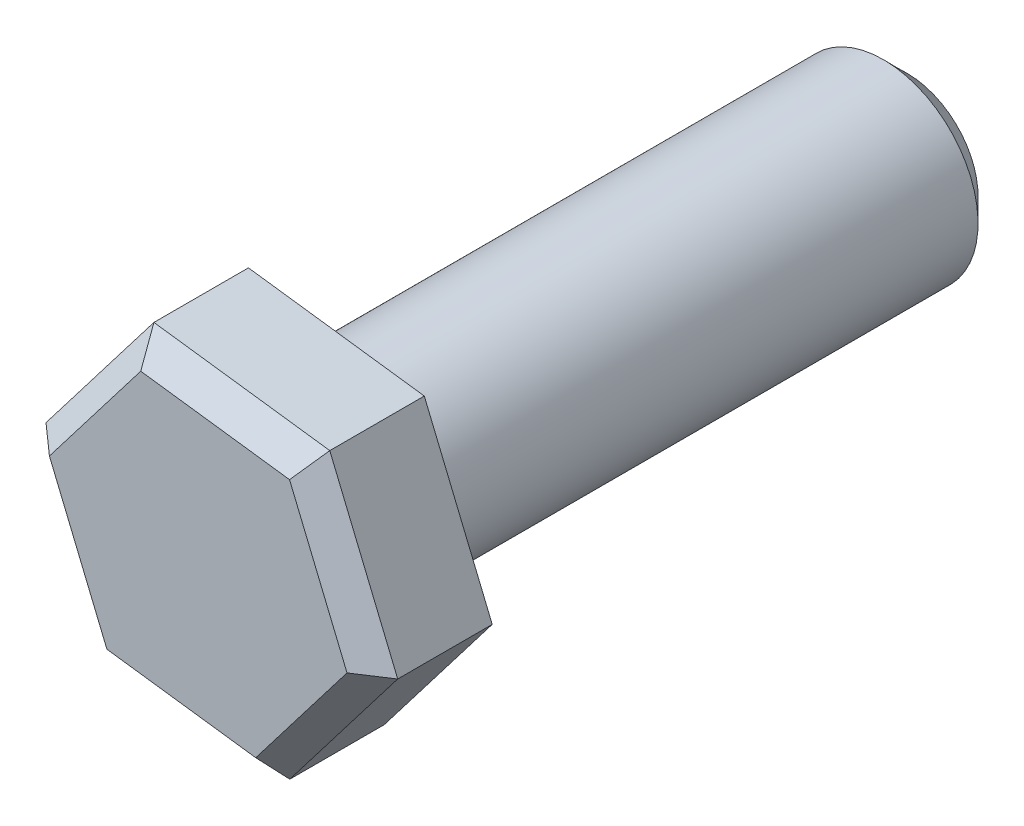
ISO-10303-21;
HEADER;
FILE_DESCRIPTION(('STEP AP214'),'2;1');
FILE_NAME('part.step','',(''),(''),'','','');
FILE_SCHEMA(('AUTOMOTIVE_DESIGN { 1 0 10303 214 1 1 1 1 }'));
ENDSEC;
DATA;
#1=APPLICATION_CONTEXT('core data for automotive mechanical design processes');
#2=APPLICATION_PROTOCOL_DEFINITION('international standard','automotive_design',2000,#1);
#3=PRODUCT_CONTEXT('',#1,'mechanical');
#4=PRODUCT('Part','Part','',(#3));
#5=PRODUCT_RELATED_PRODUCT_CATEGORY('part','',(#4));
#6=PRODUCT_DEFINITION_FORMATION('','',#4);
#7=PRODUCT_DEFINITION_CONTEXT('part definition',#1,'design');
#8=PRODUCT_DEFINITION('design','',#6,#7);
#9=PRODUCT_DEFINITION_SHAPE('','',#8);
#10=(LENGTH_UNIT() NAMED_UNIT(*) SI_UNIT(.MILLI.,.METRE.));
#11=(NAMED_UNIT(*) PLANE_ANGLE_UNIT() SI_UNIT($,.RADIAN.));
#12=(NAMED_UNIT(*) SI_UNIT($,.STERADIAN.) SOLID_ANGLE_UNIT());
#13=UNCERTAINTY_MEASURE_WITH_UNIT(LENGTH_MEASURE(1.E-05),#10,'distance_accuracy_value','');
#14=(GEOMETRIC_REPRESENTATION_CONTEXT(3) GLOBAL_UNCERTAINTY_ASSIGNED_CONTEXT((#13)) GLOBAL_UNIT_ASSIGNED_CONTEXT((#10,
#11,#12)) REPRESENTATION_CONTEXT('',''));
#15=CARTESIAN_POINT('',(0.,0.,0.));
#16=DIRECTION('',(0.,0.,1.));
#17=DIRECTION('',(1.,0.,0.));
#18=AXIS2_PLACEMENT_3D('',#15,#16,#17);
#19=CARTESIAN_POINT('',(829.485833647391,146.917769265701,43.5000000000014));
#20=DIRECTION('',(0.,0.,1.));
#21=DIRECTION('',(0.923728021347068,0.383049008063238,0.));
#22=AXIS2_PLACEMENT_3D('',#19,#20,#21);
#23=PLANE('',#22);
#24=DIRECTION('',(-0.991496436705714,0.130133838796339,0.));
#25=VECTOR('',#24,1.);
#26=CARTESIAN_POINT('',(829.485833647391,146.917769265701,43.5000000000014));
#27=LINE('',#26,#25);
#28=CARTESIAN_POINT('',(829.485833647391,146.917769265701,43.5000000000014));
#29=VERTEX_POINT('',#28);
#30=CARTESIAN_POINT('',(822.044104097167,147.894495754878,43.5000000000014));
#31=VERTEX_POINT('',#30);
#32=EDGE_CURVE('E100',#29,#31,#27,.T.);
#33=ORIENTED_EDGE('',*,*,#32,.T.);
#34=DIRECTION('',(-0.383049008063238,0.923728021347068,0.));
#35=VECTOR('',#34,1.);
#36=CARTESIAN_POINT('',(822.044104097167,147.894495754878,43.5000000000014));
#37=LINE('',#36,#35);
#38=CARTESIAN_POINT('',(819.169109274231,154.827585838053,43.5000000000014));
#39=VERTEX_POINT('',#38);
#40=EDGE_CURVE('E88',#31,#39,#37,.T.);
#41=ORIENTED_EDGE('',*,*,#40,.T.);
#42=DIRECTION('',(0.608447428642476,0.793594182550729,0.));
#43=VECTOR('',#42,1.);
#44=CARTESIAN_POINT('',(819.169109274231,154.827585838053,43.5000000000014));
#45=LINE('',#44,#43);
#46=CARTESIAN_POINT('',(823.735844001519,160.783949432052,43.5000000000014));
#47=VERTEX_POINT('',#46);
#48=EDGE_CURVE('E99',#39,#47,#45,.T.);
#49=ORIENTED_EDGE('',*,*,#48,.T.);
#50=DIRECTION('',(0.991496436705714,-0.130133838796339,0.));
#51=VECTOR('',#50,1.);
#52=CARTESIAN_POINT('',(823.735844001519,160.783949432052,43.5000000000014));
#53=LINE('',#52,#51);
#54=CARTESIAN_POINT('',(831.177573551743,159.807222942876,43.5000000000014));
#55=VERTEX_POINT('',#54);
#56=EDGE_CURVE('E178',#47,#55,#53,.T.);
#57=ORIENTED_EDGE('',*,*,#56,.T.);
#58=DIRECTION('',(0.383049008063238,-0.923728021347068,0.));
#59=VECTOR('',#58,1.);
#60=CARTESIAN_POINT('',(831.177573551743,159.807222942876,43.5000000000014));
#61=LINE('',#60,#59);
#62=CARTESIAN_POINT('',(834.052568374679,152.8741328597,43.5000000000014));
#63=VERTEX_POINT('',#62);
#64=EDGE_CURVE('E157',#55,#63,#61,.T.);
#65=ORIENTED_EDGE('',*,*,#64,.T.);
#66=DIRECTION('',(-0.608447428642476,-0.793594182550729,0.));
#67=VECTOR('',#66,1.);
#68=CARTESIAN_POINT('',(834.052568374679,152.8741328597,43.5000000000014));
#69=LINE('',#68,#67);
#70=EDGE_CURVE('E105',#63,#29,#69,.T.);
#71=ORIENTED_EDGE('',*,*,#70,.T.);
#72=EDGE_LOOP('',(#33,#41,#49,#57,#65,#71));
#73=FACE_BOUND('',#72,.T.);
#74=CARTESIAN_POINT('',(826.610838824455,153.850859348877,43.5000000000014));
#75=DIRECTION('',(0.,0.,1.));
#76=DIRECTION('',(0.923728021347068,0.383049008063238,0.));
#77=AXIS2_PLACEMENT_3D('',#74,#75,#76);
#78=CIRCLE('',#77,4.);
#79=CARTESIAN_POINT('',(830.305750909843,155.38305538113,43.5000000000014));
#80=VERTEX_POINT('',#79);
#81=EDGE_CURVE('E110',#80,#80,#78,.F.);
#82=ORIENTED_EDGE('',*,*,#81,.F.);
#83=EDGE_LOOP('',(#82));
#84=FACE_BOUND('',#83,.T.);
#85=ADVANCED_FACE('F16',(#73,#84),#23,.F.);
#86=CARTESIAN_POINT('',(829.485833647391,146.917769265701,43.5000000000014));
#87=DIRECTION('',(0.130133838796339,0.991496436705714,0.));
#88=DIRECTION('',(0.991496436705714,-0.130133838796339,0.));
#89=AXIS2_PLACEMENT_3D('',#86,#87,#88);
#90=PLANE('',#89);
#91=DIRECTION('',(0.,0.,1.));
#92=VECTOR('',#91,1.);
#93=CARTESIAN_POINT('',(829.485833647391,146.917769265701,43.5000000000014));
#94=LINE('',#93,#92);
#95=CARTESIAN_POINT('',(829.485833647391,146.917769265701,47.5000000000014));
#96=VERTEX_POINT('',#95);
#97=EDGE_CURVE('E182',#29,#96,#94,.T.);
#98=ORIENTED_EDGE('',*,*,#97,.T.);
#99=DIRECTION('',(-0.991496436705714,0.130133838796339,0.));
#100=VECTOR('',#99,1.);
#101=CARTESIAN_POINT('',(822.044104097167,147.894495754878,47.5000000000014));
#102=LINE('',#101,#100);
#103=CARTESIAN_POINT('',(822.044104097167,147.894495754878,47.5000000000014));
#104=VERTEX_POINT('',#103);
#105=EDGE_CURVE('E11',#96,#104,#102,.T.);
#106=ORIENTED_EDGE('',*,*,#105,.T.);
#107=DIRECTION('',(0.,0.,1.));
#108=VECTOR('',#107,1.);
#109=CARTESIAN_POINT('',(822.044104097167,147.894495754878,43.5000000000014));
#110=LINE('',#109,#108);
#111=EDGE_CURVE('E93',#31,#104,#110,.T.);
#112=ORIENTED_EDGE('',*,*,#111,.F.);
#113=ORIENTED_EDGE('',*,*,#32,.F.);
#114=EDGE_LOOP('',(#98,#106,#112,#113));
#115=FACE_BOUND('',#114,.T.);
#116=ADVANCED_FACE('F18',(#115),#90,.F.);
#117=CARTESIAN_POINT('',(822.044104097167,147.894495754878,43.5000000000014));
#118=DIRECTION('',(0.923728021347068,0.383049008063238,0.));
#119=DIRECTION('',(0.,0.,-1.));
#120=AXIS2_PLACEMENT_3D('',#117,#118,#119);
#121=PLANE('',#120);
#122=ORIENTED_EDGE('',*,*,#111,.T.);
#123=DIRECTION('',(-0.383049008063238,0.923728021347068,0.));
#124=VECTOR('',#123,1.);
#125=CARTESIAN_POINT('',(819.169109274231,154.827585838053,47.5000000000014));
#126=LINE('',#125,#124);
#127=CARTESIAN_POINT('',(819.169109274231,154.827585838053,47.5000000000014));
#128=VERTEX_POINT('',#127);
#129=EDGE_CURVE('E124',#104,#128,#126,.T.);
#130=ORIENTED_EDGE('',*,*,#129,.T.);
#131=DIRECTION('',(0.,0.,1.));
#132=VECTOR('',#131,1.);
#133=CARTESIAN_POINT('',(819.169109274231,154.827585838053,43.5000000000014));
#134=LINE('',#133,#132);
#135=EDGE_CURVE('E96',#39,#128,#134,.T.);
#136=ORIENTED_EDGE('',*,*,#135,.F.);
#137=ORIENTED_EDGE('',*,*,#40,.F.);
#138=EDGE_LOOP('',(#122,#130,#136,#137));
#139=FACE_BOUND('',#138,.T.);
#140=ADVANCED_FACE('F90',(#139),#121,.F.);
#141=CARTESIAN_POINT('',(819.169109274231,154.827585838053,43.5000000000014));
#142=DIRECTION('',(0.793594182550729,-0.608447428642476,0.));
#143=DIRECTION('',(-0.608447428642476,-0.793594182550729,0.));
#144=AXIS2_PLACEMENT_3D('',#141,#142,#143);
#145=PLANE('',#144);
#146=ORIENTED_EDGE('',*,*,#135,.T.);
#147=DIRECTION('',(0.608447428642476,0.793594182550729,0.));
#148=VECTOR('',#147,1.);
#149=CARTESIAN_POINT('',(823.735844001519,160.783949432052,47.5000000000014));
#150=LINE('',#149,#148);
#151=CARTESIAN_POINT('',(823.735844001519,160.783949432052,47.5000000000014));
#152=VERTEX_POINT('',#151);
#153=EDGE_CURVE('E139',#128,#152,#150,.T.);
#154=ORIENTED_EDGE('',*,*,#153,.T.);
#155=DIRECTION('',(0.,0.,1.));
#156=VECTOR('',#155,1.);
#157=CARTESIAN_POINT('',(823.735844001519,160.783949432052,43.5000000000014));
#158=LINE('',#157,#156);
#159=EDGE_CURVE('E115',#47,#152,#158,.T.);
#160=ORIENTED_EDGE('',*,*,#159,.F.);
#161=ORIENTED_EDGE('',*,*,#48,.F.);
#162=EDGE_LOOP('',(#146,#154,#160,#161));
#163=FACE_BOUND('',#162,.T.);
#164=ADVANCED_FACE('F202',(#163),#145,.F.);
#165=CARTESIAN_POINT('',(823.735844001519,160.783949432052,43.5000000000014));
#166=DIRECTION('',(-0.130133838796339,-0.991496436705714,0.));
#167=DIRECTION('',(-0.991496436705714,0.130133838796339,0.));
#168=AXIS2_PLACEMENT_3D('',#165,#166,#167);
#169=PLANE('',#168);
#170=ORIENTED_EDGE('',*,*,#159,.T.);
#171=DIRECTION('',(0.991496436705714,-0.130133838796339,0.));
#172=VECTOR('',#171,1.);
#173=CARTESIAN_POINT('',(831.177573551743,159.807222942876,47.5000000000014));
#174=LINE('',#173,#172);
#175=CARTESIAN_POINT('',(831.177573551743,159.807222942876,47.5000000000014));
#176=VERTEX_POINT('',#175);
#177=EDGE_CURVE('E141',#152,#176,#174,.T.);
#178=ORIENTED_EDGE('',*,*,#177,.T.);
#179=DIRECTION('',(0.,0.,1.));
#180=VECTOR('',#179,1.);
#181=CARTESIAN_POINT('',(831.177573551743,159.807222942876,43.5000000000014));
#182=LINE('',#181,#180);
#183=EDGE_CURVE('E149',#55,#176,#182,.T.);
#184=ORIENTED_EDGE('',*,*,#183,.F.);
#185=ORIENTED_EDGE('',*,*,#56,.F.);
#186=EDGE_LOOP('',(#170,#178,#184,#185));
#187=FACE_BOUND('',#186,.T.);
#188=ADVANCED_FACE('F147',(#187),#169,.F.);
#189=CARTESIAN_POINT('',(831.177573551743,159.807222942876,43.5000000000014));
#190=DIRECTION('',(-0.923728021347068,-0.383049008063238,0.));
#191=DIRECTION('',(0.,0.,1.));
#192=AXIS2_PLACEMENT_3D('',#189,#190,#191);
#193=PLANE('',#192);
#194=ORIENTED_EDGE('',*,*,#183,.T.);
#195=DIRECTION('',(0.383049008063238,-0.923728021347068,0.));
#196=VECTOR('',#195,1.);
#197=CARTESIAN_POINT('',(834.052568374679,152.8741328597,47.5000000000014));
#198=LINE('',#197,#196);
#199=CARTESIAN_POINT('',(834.052568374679,152.8741328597,47.5000000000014));
#200=VERTEX_POINT('',#199);
#201=EDGE_CURVE('E38',#176,#200,#198,.T.);
#202=ORIENTED_EDGE('',*,*,#201,.T.);
#203=DIRECTION('',(0.,0.,1.));
#204=VECTOR('',#203,1.);
#205=CARTESIAN_POINT('',(834.052568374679,152.8741328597,43.5000000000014));
#206=LINE('',#205,#204);
#207=EDGE_CURVE('E158',#63,#200,#206,.T.);
#208=ORIENTED_EDGE('',*,*,#207,.F.);
#209=ORIENTED_EDGE('',*,*,#64,.F.);
#210=EDGE_LOOP('',(#194,#202,#208,#209));
#211=FACE_BOUND('',#210,.T.);
#212=ADVANCED_FACE('F156',(#211),#193,.F.);
#213=CARTESIAN_POINT('',(834.052568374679,152.8741328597,43.5000000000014));
#214=DIRECTION('',(-0.793594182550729,0.608447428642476,0.));
#215=DIRECTION('',(0.608447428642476,0.793594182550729,0.));
#216=AXIS2_PLACEMENT_3D('',#213,#214,#215);
#217=PLANE('',#216);
#218=ORIENTED_EDGE('',*,*,#207,.T.);
#219=DIRECTION('',(-0.608447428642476,-0.793594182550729,0.));
#220=VECTOR('',#219,1.);
#221=CARTESIAN_POINT('',(829.485833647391,146.917769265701,47.5000000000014));
#222=LINE('',#221,#220);
#223=EDGE_CURVE('E24',#200,#96,#222,.T.);
#224=ORIENTED_EDGE('',*,*,#223,.T.);
#225=ORIENTED_EDGE('',*,*,#97,.F.);
#226=ORIENTED_EDGE('',*,*,#70,.F.);
#227=EDGE_LOOP('',(#218,#224,#225,#226));
#228=FACE_BOUND('',#227,.T.);
#229=ADVANCED_FACE('F184',(#228),#217,.F.);
#230=CARTESIAN_POINT('',(829.485833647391,146.917769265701,48.5000000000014));
#231=DIRECTION('',(0.,0.,1.));
#232=DIRECTION('',(0.923728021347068,0.383049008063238,0.));
#233=AXIS2_PLACEMENT_3D('',#230,#231,#232);
#234=PLANE('',#233);
#235=DIRECTION('',(-0.608447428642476,-0.793594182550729,0.));
#236=VECTOR('',#235,1.);
#237=CARTESIAN_POINT('',(819.962703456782,154.219138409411,48.5000000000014));
#238=LINE('',#237,#236);
#239=CARTESIAN_POINT('',(824.178150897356,159.717320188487,48.5000000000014));
#240=VERTEX_POINT('',#239);
#241=CARTESIAN_POINT('',(820.313990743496,154.677320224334,48.5000000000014));
#242=VERTEX_POINT('',#241);
#243=EDGE_CURVE('E134',#240,#242,#238,.T.);
#244=ORIENTED_EDGE('',*,*,#243,.T.);
#245=DIRECTION('',(0.383049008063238,-0.923728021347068,0.));
#246=VECTOR('',#245,1.);
#247=CARTESIAN_POINT('',(822.967832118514,148.277544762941,48.5000000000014));
#248=LINE('',#247,#246);
#249=CARTESIAN_POINT('',(822.746678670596,148.810859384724,48.5000000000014));
#250=VERTEX_POINT('',#249);
#251=EDGE_CURVE('E136',#242,#250,#248,.T.);
#252=ORIENTED_EDGE('',*,*,#251,.T.);
#253=DIRECTION('',(0.991496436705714,-0.130133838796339,0.));
#254=VECTOR('',#253,1.);
#255=CARTESIAN_POINT('',(829.615967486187,147.909265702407,48.5000000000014));
#256=LINE('',#255,#254);
#257=CARTESIAN_POINT('',(829.043526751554,147.984398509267,48.5000000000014));
#258=VERTEX_POINT('',#257);
#259=EDGE_CURVE('E126',#250,#258,#256,.T.);
#260=ORIENTED_EDGE('',*,*,#259,.T.);
#261=DIRECTION('',(0.608447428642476,0.793594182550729,0.));
#262=VECTOR('',#261,1.);
#263=CARTESIAN_POINT('',(833.258974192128,153.482580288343,48.5000000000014));
#264=LINE('',#263,#262);
#265=CARTESIAN_POINT('',(832.907686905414,153.02439847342,48.5000000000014));
#266=VERTEX_POINT('',#265);
#267=EDGE_CURVE('E128',#258,#266,#264,.T.);
#268=ORIENTED_EDGE('',*,*,#267,.T.);
#269=DIRECTION('',(-0.383049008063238,0.923728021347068,0.));
#270=VECTOR('',#269,1.);
#271=CARTESIAN_POINT('',(830.253845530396,159.424173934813,48.5000000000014));
#272=LINE('',#271,#270);
#273=CARTESIAN_POINT('',(830.474998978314,158.89085931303,48.5000000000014));
#274=VERTEX_POINT('',#273);
#275=EDGE_CURVE('E130',#266,#274,#272,.T.);
#276=ORIENTED_EDGE('',*,*,#275,.T.);
#277=DIRECTION('',(-0.991496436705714,0.130133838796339,0.));
#278=VECTOR('',#277,1.);
#279=CARTESIAN_POINT('',(823.605710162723,159.792452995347,48.5000000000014));
#280=LINE('',#279,#278);
#281=EDGE_CURVE('E132',#274,#240,#280,.T.);
#282=ORIENTED_EDGE('',*,*,#281,.T.);
#283=EDGE_LOOP('',(#244,#252,#260,#268,#276,#282));
#284=FACE_BOUND('',#283,.T.);
#285=ADVANCED_FACE('F208',(#284),#234,.T.);
#286=CARTESIAN_POINT('',(826.610838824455,153.850859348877,18.5000000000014));
#287=DIRECTION('',(0.,0.,1.));
#288=DIRECTION('',(0.923728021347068,0.383049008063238,0.));
#289=AXIS2_PLACEMENT_3D('',#286,#287,#288);
#290=CYLINDRICAL_SURFACE('',#289,4.);
#291=CARTESIAN_POINT('',(826.610838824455,153.850859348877,19.5000000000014));
#292=DIRECTION('',(0.,0.,-1.));
#293=DIRECTION('',(-0.923728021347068,-0.383049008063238,0.));
#294=AXIS2_PLACEMENT_3D('',#291,#292,#293);
#295=CIRCLE('',#294,4.);
#296=CARTESIAN_POINT('',(822.915926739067,152.318663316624,19.5000000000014));
#297=VERTEX_POINT('',#296);
#298=EDGE_CURVE('E121',#297,#297,#295,.F.);
#299=ORIENTED_EDGE('',*,*,#298,.T.);
#300=EDGE_LOOP('',(#299));
#301=FACE_BOUND('',#300,.T.);
#302=ORIENTED_EDGE('',*,*,#81,.T.);
#303=EDGE_LOOP('',(#302));
#304=FACE_BOUND('',#303,.T.);
#305=ADVANCED_FACE('F210',(#301,#304),#290,.T.);
#306=CARTESIAN_POINT('',(826.610838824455,153.850859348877,18.5000000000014));
#307=DIRECTION('',(0.,0.,-1.));
#308=DIRECTION('',(-0.923728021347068,-0.383049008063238,0.));
#309=AXIS2_PLACEMENT_3D('',#306,#307,#308);
#310=PLANE('',#309);
#311=CARTESIAN_POINT('',(826.610838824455,153.850859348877,18.5000000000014));
#312=DIRECTION('',(0.,0.,-1.));
#313=DIRECTION('',(-0.923728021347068,-0.383049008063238,0.));
#314=AXIS2_PLACEMENT_3D('',#311,#312,#313);
#315=CIRCLE('',#314,3.);
#316=CARTESIAN_POINT('',(823.839654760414,152.701712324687,18.5000000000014));
#317=VERTEX_POINT('',#316);
#318=EDGE_CURVE('E113',#317,#317,#315,.T.);
#319=ORIENTED_EDGE('',*,*,#318,.T.);
#320=EDGE_LOOP('',(#319));
#321=FACE_BOUND('',#320,.T.);
#322=ADVANCED_FACE('F218',(#321),#310,.T.);
#323=CARTESIAN_POINT('',(826.610838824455,153.850859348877,18.5000000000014));
#324=DIRECTION('',(0.,0.,1.));
#325=DIRECTION('',(0.923728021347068,0.383049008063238,0.));
#326=AXIS2_PLACEMENT_3D('',#323,#324,#325);
#327=CONICAL_SURFACE('',#326,3.,0.785398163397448);
#328=ORIENTED_EDGE('',*,*,#298,.F.);
#329=EDGE_LOOP('',(#328));
#330=FACE_BOUND('',#329,.T.);
#331=ORIENTED_EDGE('',*,*,#318,.F.);
#332=EDGE_LOOP('',(#331));
#333=FACE_BOUND('',#332,.T.);
#334=ADVANCED_FACE('F275',(#330,#333),#327,.T.);
#335=CARTESIAN_POINT('',(831.177573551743,159.807222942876,47.5000000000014));
#336=DIRECTION('',(0.653174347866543,0.270856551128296,0.707106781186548));
#337=DIRECTION('',(0.653174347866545,0.270856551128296,-0.707106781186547));
#338=AXIS2_PLACEMENT_3D('',#335,#336,#337);
#339=PLANE('',#338);
#340=DIRECTION('',(-0.459943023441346,-0.59990081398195,0.654653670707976));
#341=VECTOR('',#340,1.);
#342=CARTESIAN_POINT('',(831.177573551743,159.807222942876,47.5000000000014));
#343=LINE('',#342,#341);
#344=EDGE_CURVE('E165',#274,#176,#343,.F.);
#345=ORIENTED_EDGE('',*,*,#344,.F.);
#346=ORIENTED_EDGE('',*,*,#275,.F.);
#347=DIRECTION('',(-0.749500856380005,0.0983719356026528,0.654653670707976));
#348=VECTOR('',#347,1.);
#349=CARTESIAN_POINT('',(834.052568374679,152.8741328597,47.5000000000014));
#350=LINE('',#349,#348);
#351=EDGE_CURVE('E107',#200,#266,#350,.T.);
#352=ORIENTED_EDGE('',*,*,#351,.F.);
#353=ORIENTED_EDGE('',*,*,#201,.F.);
#354=EDGE_LOOP('',(#345,#346,#352,#353));
#355=FACE_BOUND('',#354,.T.);
#356=ADVANCED_FACE('F163',(#355),#339,.T.);
#357=CARTESIAN_POINT('',(834.052568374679,152.8741328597,47.5000000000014));
#358=DIRECTION('',(0.561155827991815,-0.430237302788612,0.707106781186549));
#359=DIRECTION('',(-0.289557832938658,0.698272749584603,0.654653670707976));
#360=AXIS2_PLACEMENT_3D('',#357,#358,#359);
#361=PLANE('',#360);
#362=ORIENTED_EDGE('',*,*,#351,.T.);
#363=ORIENTED_EDGE('',*,*,#267,.F.);
#364=DIRECTION('',(-0.289557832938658,0.698272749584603,0.654653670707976));
#365=VECTOR('',#364,1.);
#366=CARTESIAN_POINT('',(829.485833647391,146.917769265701,47.5000000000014));
#367=LINE('',#366,#365);
#368=EDGE_CURVE('E169',#96,#258,#367,.T.);
#369=ORIENTED_EDGE('',*,*,#368,.F.);
#370=ORIENTED_EDGE('',*,*,#223,.F.);
#371=EDGE_LOOP('',(#362,#363,#369,#370));
#372=FACE_BOUND('',#371,.T.);
#373=ADVANCED_FACE('F188',(#372),#361,.T.);
#374=CARTESIAN_POINT('',(823.735844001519,160.783949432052,47.5000000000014));
#375=DIRECTION('',(0.0920185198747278,0.701093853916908,0.707106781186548));
#376=DIRECTION('',(-0.289557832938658,0.698272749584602,-0.654653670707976));
#377=AXIS2_PLACEMENT_3D('',#374,#375,#376);
#378=PLANE('',#377);
#379=ORIENTED_EDGE('',*,*,#344,.T.);
#380=ORIENTED_EDGE('',*,*,#177,.F.);
#381=DIRECTION('',(0.289557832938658,-0.698272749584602,0.654653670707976));
#382=VECTOR('',#381,1.);
#383=CARTESIAN_POINT('',(823.735844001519,160.783949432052,47.5000000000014));
#384=LINE('',#383,#382);
#385=EDGE_CURVE('E173',#240,#152,#384,.F.);
#386=ORIENTED_EDGE('',*,*,#385,.F.);
#387=ORIENTED_EDGE('',*,*,#281,.F.);
#388=EDGE_LOOP('',(#379,#380,#386,#387));
#389=FACE_BOUND('',#388,.T.);
#390=ADVANCED_FACE('F168',(#389),#378,.T.);
#391=CARTESIAN_POINT('',(829.485833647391,146.917769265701,47.5000000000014));
#392=DIRECTION('',(-0.0920185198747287,-0.701093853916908,0.707106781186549));
#393=DIRECTION('',(-0.289557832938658,0.698272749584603,0.654653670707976));
#394=AXIS2_PLACEMENT_3D('',#391,#392,#393);
#395=PLANE('',#394);
#396=ORIENTED_EDGE('',*,*,#368,.T.);
#397=ORIENTED_EDGE('',*,*,#259,.F.);
#398=DIRECTION('',(-0.459943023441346,-0.59990081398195,-0.654653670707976));
#399=VECTOR('',#398,1.);
#400=CARTESIAN_POINT('',(823.348885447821,149.596313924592,49.3571428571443));
#401=LINE('',#400,#399);
#402=EDGE_CURVE('E192',#104,#250,#401,.F.);
#403=ORIENTED_EDGE('',*,*,#402,.F.);
#404=ORIENTED_EDGE('',*,*,#105,.F.);
#405=EDGE_LOOP('',(#396,#397,#403,#404));
#406=FACE_BOUND('',#405,.T.);
#407=ADVANCED_FACE('F191',(#406),#395,.T.);
#408=CARTESIAN_POINT('',(819.169109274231,154.827585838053,47.5000000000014));
#409=DIRECTION('',(-0.561155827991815,0.430237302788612,0.707106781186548));
#410=DIRECTION('',(-0.289557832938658,0.698272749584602,-0.654653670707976));
#411=AXIS2_PLACEMENT_3D('',#408,#409,#410);
#412=PLANE('',#411);
#413=ORIENTED_EDGE('',*,*,#385,.T.);
#414=ORIENTED_EDGE('',*,*,#153,.F.);
#415=DIRECTION('',(0.749500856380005,-0.0983719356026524,0.654653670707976));
#416=VECTOR('',#415,1.);
#417=CARTESIAN_POINT('',(819.169109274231,154.827585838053,47.5000000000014));
#418=LINE('',#417,#416);
#419=EDGE_CURVE('E196',#242,#128,#418,.F.);
#420=ORIENTED_EDGE('',*,*,#419,.F.);
#421=ORIENTED_EDGE('',*,*,#243,.F.);
#422=EDGE_LOOP('',(#413,#414,#420,#421));
#423=FACE_BOUND('',#422,.T.);
#424=ADVANCED_FACE('F204',(#423),#412,.T.);
#425=CARTESIAN_POINT('',(822.044104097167,147.894495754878,47.5000000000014));
#426=DIRECTION('',(-0.653174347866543,-0.270856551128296,0.707106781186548));
#427=DIRECTION('',(0.653174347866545,0.270856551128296,0.707106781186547));
#428=AXIS2_PLACEMENT_3D('',#425,#426,#427);
#429=PLANE('',#428);
#430=ORIENTED_EDGE('',*,*,#402,.T.);
#431=ORIENTED_EDGE('',*,*,#251,.F.);
#432=ORIENTED_EDGE('',*,*,#419,.T.);
#433=ORIENTED_EDGE('',*,*,#129,.F.);
#434=EDGE_LOOP('',(#430,#431,#432,#433));
#435=FACE_BOUND('',#434,.T.);
#436=ADVANCED_FACE('F198',(#435),#429,.T.);
#437=CLOSED_SHELL('',(#85,#116,#140,#164,#188,#212,#229,#285,#305,#322,#334,#356,#373,#390,#407,
#424,#436));
#438=MANIFOLD_SOLID_BREP('B1',#437);
#439=ADVANCED_BREP_SHAPE_REPRESENTATION('',(#18,#438),#14);
#440=SHAPE_DEFINITION_REPRESENTATION(#9,#439);
ENDSEC;
END-ISO-10303-21;
